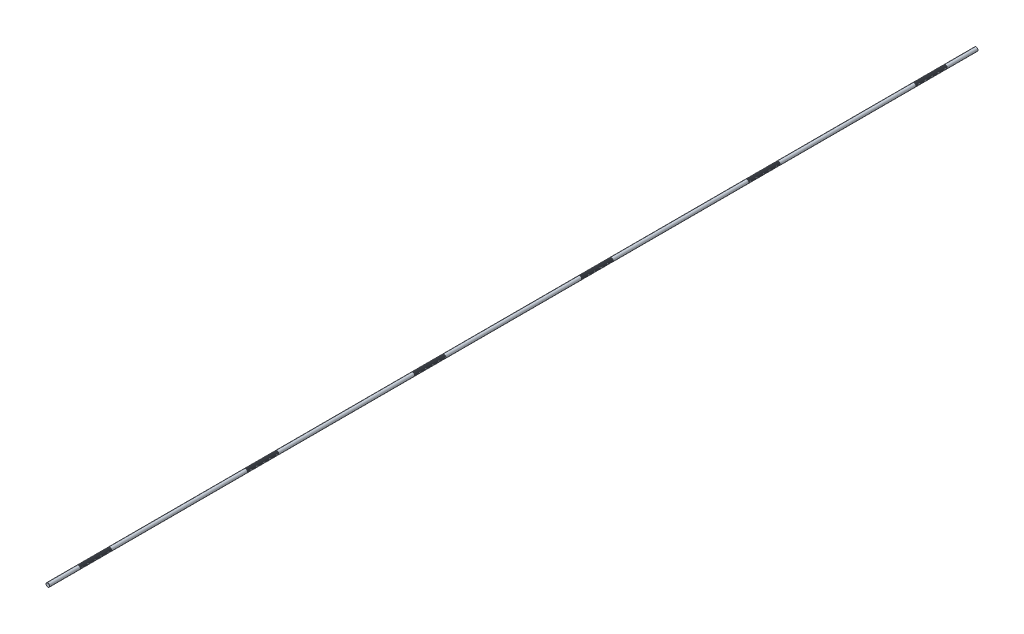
from build123d import *

# Parameters (mm, degrees)
SKETCH1_R           = 6
BOSS_EXTRUDE1_DEPTH = 1500
CHAMFER1_SIZE       = 0.3
LPATTERN1_COUNT     = 34
LPATTERN1_PITCH     = 3
LPATTERN2_COUNT     = 6
LPATTERN2_PITCH     = 540


with BuildPart() as part:
    # Sketch1 → Boss-Extrude1 (new, symmetric)
    with BuildSketch(Plane.XY):
        Circle(SKETCH1_R)
    extrude(amount=BOSS_EXTRUDE1_DEPTH, both=True)

    # Chamfer1
    chamfer1_edges = [part.edges().sort_by_distance(p)[0] for p in [
        (-6, 0, -1500),
        (-6, 0, 1500),
    ]]
    chamfer(chamfer1_edges, length=CHAMFER1_SIZE)

    # Sketch2 → Cut-Revolve1 (revolve, cut)
    with BuildSketch(Plane(origin=(0, 0, 0), x_dir=(0, 0, -1), z_dir=(1, 0, 0)), mode=Mode.PRIVATE) as cut_revolve1_sk:
        Polygon((1400.234455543, 6), (1398.265544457, 6), (1398.734455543, 4.25), (1399.765544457, 4.25), align=None)
    cut_revolve1 = revolve(cut_revolve1_sk.sketch.rotate(Axis((0, 0, 1500), (0, 0, -1)), 90), axis=Axis((0, 0, 1500), (0, 0, -1)), mode=Mode.SUBTRACT)

    # LPattern1: Cut-Revolve1 ×34
    with Locations(*[(0, 0, i * LPATTERN1_PITCH) for i in range(1, LPATTERN1_COUNT)]):
        add(cut_revolve1, mode=Mode.SUBTRACT)

    # LPattern2: Cut-Revolve1 ×6
    with Locations(*[(0, 0, i * LPATTERN2_PITCH) for i in range(1, LPATTERN2_COUNT)]):
        add(cut_revolve1, mode=Mode.SUBTRACT)

    # LPattern2 copy 1 sketch → LPattern2 copy 1 (revolve, cut)
    with BuildSketch(Plane(origin=(0, 0, 543), x_dir=(0, 0, -1), z_dir=(1, 0, 0))):
        Polygon((1400.234455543, 6), (1398.265544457, 6), (1398.734455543, 4.25), (1399.765544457, 4.25), align=None)
    revolve(axis=Axis((0, 0, 2043), (0, 0, -1)), mode=Mode.SUBTRACT)

    # LPattern2 copy 2 sketch → LPattern2 copy 2 (revolve, cut)
    with BuildSketch(Plane(origin=(0, 0, 1083), x_dir=(0, 0, -1), z_dir=(1, 0, 0))):
        Polygon((1400.234455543, 6), (1398.265544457, 6), (1398.734455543, 4.25), (1399.765544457, 4.25), align=None)
    revolve(axis=Axis((0, 0, 2583), (0, 0, -1)), mode=Mode.SUBTRACT)

    # LPattern2 copy 3 sketch → LPattern2 copy 3 (revolve, cut)
    with BuildSketch(Plane(origin=(0, 0, 1623), x_dir=(0, 0, -1), z_dir=(1, 0, 0))):
        Polygon((1400.234455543, 6), (1398.265544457, 6), (1398.734455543, 4.25), (1399.765544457, 4.25), align=None)
    revolve(axis=Axis((0, 0, 3123), (0, 0, -1)), mode=Mode.SUBTRACT)

    # LPattern2 copy 4 sketch → LPattern2 copy 4 (revolve, cut)
    with BuildSketch(Plane(origin=(0, 0, 2163), x_dir=(0, 0, -1), z_dir=(1, 0, 0))):
        Polygon((1400.234455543, 6), (1398.265544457, 6), (1398.734455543, 4.25), (1399.765544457, 4.25), align=None)
    revolve(axis=Axis((0, 0, 3663), (0, 0, -1)), mode=Mode.SUBTRACT)

    # LPattern2 copy 5 sketch → LPattern2 copy 5 (revolve, cut)
    with BuildSketch(Plane(origin=(0, 0, 2703), x_dir=(0, 0, -1), z_dir=(1, 0, 0))):
        Polygon((1400.234455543, 6), (1398.265544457, 6), (1398.734455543, 4.25), (1399.765544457, 4.25), align=None)
    revolve(axis=Axis((0, 0, 4203), (0, 0, -1)), mode=Mode.SUBTRACT)

    # LPattern2 copy 6 sketch → LPattern2 copy 6 (revolve, cut)
    with BuildSketch(Plane(origin=(0, 0, 546), x_dir=(0, 0, -1), z_dir=(1, 0, 0))):
        Polygon((1400.234455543, 6), (1398.265544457, 6), (1398.734455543, 4.25), (1399.765544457, 4.25), align=None)
    revolve(axis=Axis((0, 0, 2046), (0, 0, -1)), mode=Mode.SUBTRACT)

    # LPattern2 copy 7 sketch → LPattern2 copy 7 (revolve, cut)
    with BuildSketch(Plane(origin=(0, 0, 1086), x_dir=(0, 0, -1), z_dir=(1, 0, 0))):
        Polygon((1400.234455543, 6), (1398.265544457, 6), (1398.734455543, 4.25), (1399.765544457, 4.25), align=None)
    revolve(axis=Axis((0, 0, 2586), (0, 0, -1)), mode=Mode.SUBTRACT)

    # LPattern2 copy 8 sketch → LPattern2 copy 8 (revolve, cut)
    with BuildSketch(Plane(origin=(0, 0, 1626), x_dir=(0, 0, -1), z_dir=(1, 0, 0))):
        Polygon((1400.234455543, 6), (1398.265544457, 6), (1398.734455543, 4.25), (1399.765544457, 4.25), align=None)
    revolve(axis=Axis((0, 0, 3126), (0, 0, -1)), mode=Mode.SUBTRACT)

    # LPattern2 copy 9 sketch → LPattern2 copy 9 (revolve, cut)
    with BuildSketch(Plane(origin=(0, 0, 2166), x_dir=(0, 0, -1), z_dir=(1, 0, 0))):
        Polygon((1400.234455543, 6), (1398.265544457, 6), (1398.734455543, 4.25), (1399.765544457, 4.25), align=None)
    revolve(axis=Axis((0, 0, 3666), (0, 0, -1)), mode=Mode.SUBTRACT)

    # LPattern2 copy 10 sketch → LPattern2 copy 10 (revolve, cut)
    with BuildSketch(Plane(origin=(0, 0, 2706), x_dir=(0, 0, -1), z_dir=(1, 0, 0))):
        Polygon((1400.234455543, 6), (1398.265544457, 6), (1398.734455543, 4.25), (1399.765544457, 4.25), align=None)
    revolve(axis=Axis((0, 0, 4206), (0, 0, -1)), mode=Mode.SUBTRACT)

    # LPattern2 copy 11 sketch → LPattern2 copy 11 (revolve, cut)
    with BuildSketch(Plane(origin=(0, 0, 549), x_dir=(0, 0, -1), z_dir=(1, 0, 0))):
        Polygon((1400.234455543, 6), (1398.265544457, 6), (1398.734455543, 4.25), (1399.765544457, 4.25), align=None)
    revolve(axis=Axis((0, 0, 2049), (0, 0, -1)), mode=Mode.SUBTRACT)

    # LPattern2 copy 12 sketch → LPattern2 copy 12 (revolve, cut)
    with BuildSketch(Plane(origin=(0, 0, 1089), x_dir=(0, 0, -1), z_dir=(1, 0, 0))):
        Polygon((1400.234455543, 6), (1398.265544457, 6), (1398.734455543, 4.25), (1399.765544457, 4.25), align=None)
    revolve(axis=Axis((0, 0, 2589), (0, 0, -1)), mode=Mode.SUBTRACT)

    # LPattern2 copy 13 sketch → LPattern2 copy 13 (revolve, cut)
    with BuildSketch(Plane(origin=(0, 0, 1629), x_dir=(0, 0, -1), z_dir=(1, 0, 0))):
        Polygon((1400.234455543, 6), (1398.265544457, 6), (1398.734455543, 4.25), (1399.765544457, 4.25), align=None)
    revolve(axis=Axis((0, 0, 3129), (0, 0, -1)), mode=Mode.SUBTRACT)

    # LPattern2 copy 14 sketch → LPattern2 copy 14 (revolve, cut)
    with BuildSketch(Plane(origin=(0, 0, 2169), x_dir=(0, 0, -1), z_dir=(1, 0, 0))):
        Polygon((1400.234455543, 6), (1398.265544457, 6), (1398.734455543, 4.25), (1399.765544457, 4.25), align=None)
    revolve(axis=Axis((0, 0, 3669), (0, 0, -1)), mode=Mode.SUBTRACT)

    # LPattern2 copy 15 sketch → LPattern2 copy 15 (revolve, cut)
    with BuildSketch(Plane(origin=(0, 0, 2709), x_dir=(0, 0, -1), z_dir=(1, 0, 0))):
        Polygon((1400.234455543, 6), (1398.265544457, 6), (1398.734455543, 4.25), (1399.765544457, 4.25), align=None)
    revolve(axis=Axis((0, 0, 4209), (0, 0, -1)), mode=Mode.SUBTRACT)

    # LPattern2 copy 16 sketch → LPattern2 copy 16 (revolve, cut)
    with BuildSketch(Plane(origin=(0, 0, 552), x_dir=(0, 0, -1), z_dir=(1, 0, 0))):
        Polygon((1400.234455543, 6), (1398.265544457, 6), (1398.734455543, 4.25), (1399.765544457, 4.25), align=None)
    revolve(axis=Axis((0, 0, 2052), (0, 0, -1)), mode=Mode.SUBTRACT)

    # LPattern2 copy 17 sketch → LPattern2 copy 17 (revolve, cut)
    with BuildSketch(Plane(origin=(0, 0, 1092), x_dir=(0, 0, -1), z_dir=(1, 0, 0))):
        Polygon((1400.234455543, 6), (1398.265544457, 6), (1398.734455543, 4.25), (1399.765544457, 4.25), align=None)
    revolve(axis=Axis((0, 0, 2592), (0, 0, -1)), mode=Mode.SUBTRACT)

    # LPattern2 copy 18 sketch → LPattern2 copy 18 (revolve, cut)
    with BuildSketch(Plane(origin=(0, 0, 1632), x_dir=(0, 0, -1), z_dir=(1, 0, 0))):
        Polygon((1400.234455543, 6), (1398.265544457, 6), (1398.734455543, 4.25), (1399.765544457, 4.25), align=None)
    revolve(axis=Axis((0, 0, 3132), (0, 0, -1)), mode=Mode.SUBTRACT)

    # LPattern2 copy 19 sketch → LPattern2 copy 19 (revolve, cut)
    with BuildSketch(Plane(origin=(0, 0, 2172), x_dir=(0, 0, -1), z_dir=(1, 0, 0))):
        Polygon((1400.234455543, 6), (1398.265544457, 6), (1398.734455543, 4.25), (1399.765544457, 4.25), align=None)
    revolve(axis=Axis((0, 0, 3672), (0, 0, -1)), mode=Mode.SUBTRACT)

    # LPattern2 copy 20 sketch → LPattern2 copy 20 (revolve, cut)
    with BuildSketch(Plane(origin=(0, 0, 2712), x_dir=(0, 0, -1), z_dir=(1, 0, 0))):
        Polygon((1400.234455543, 6), (1398.265544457, 6), (1398.734455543, 4.25), (1399.765544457, 4.25), align=None)
    revolve(axis=Axis((0, 0, 4212), (0, 0, -1)), mode=Mode.SUBTRACT)

    # LPattern2 copy 21 sketch → LPattern2 copy 21 (revolve, cut)
    with BuildSketch(Plane(origin=(0, 0, 555), x_dir=(0, 0, -1), z_dir=(1, 0, 0))):
        Polygon((1400.234455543, 6), (1398.265544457, 6), (1398.734455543, 4.25), (1399.765544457, 4.25), align=None)
    revolve(axis=Axis((0, 0, 2055), (0, 0, -1)), mode=Mode.SUBTRACT)

    # LPattern2 copy 22 sketch → LPattern2 copy 22 (revolve, cut)
    with BuildSketch(Plane(origin=(0, 0, 1095), x_dir=(0, 0, -1), z_dir=(1, 0, 0))):
        Polygon((1400.234455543, 6), (1398.265544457, 6), (1398.734455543, 4.25), (1399.765544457, 4.25), align=None)
    revolve(axis=Axis((0, 0, 2595), (0, 0, -1)), mode=Mode.SUBTRACT)

    # LPattern2 copy 23 sketch → LPattern2 copy 23 (revolve, cut)
    with BuildSketch(Plane(origin=(0, 0, 1635), x_dir=(0, 0, -1), z_dir=(1, 0, 0))):
        Polygon((1400.234455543, 6), (1398.265544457, 6), (1398.734455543, 4.25), (1399.765544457, 4.25), align=None)
    revolve(axis=Axis((0, 0, 3135), (0, 0, -1)), mode=Mode.SUBTRACT)

    # LPattern2 copy 24 sketch → LPattern2 copy 24 (revolve, cut)
    with BuildSketch(Plane(origin=(0, 0, 2175), x_dir=(0, 0, -1), z_dir=(1, 0, 0))):
        Polygon((1400.234455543, 6), (1398.265544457, 6), (1398.734455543, 4.25), (1399.765544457, 4.25), align=None)
    revolve(axis=Axis((0, 0, 3675), (0, 0, -1)), mode=Mode.SUBTRACT)

    # LPattern2 copy 25 sketch → LPattern2 copy 25 (revolve, cut)
    with BuildSketch(Plane(origin=(0, 0, 2715), x_dir=(0, 0, -1), z_dir=(1, 0, 0))):
        Polygon((1400.234455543, 6), (1398.265544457, 6), (1398.734455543, 4.25), (1399.765544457, 4.25), align=None)
    revolve(axis=Axis((0, 0, 4215), (0, 0, -1)), mode=Mode.SUBTRACT)

    # LPattern2 copy 26 sketch → LPattern2 copy 26 (revolve, cut)
    with BuildSketch(Plane(origin=(0, 0, 558), x_dir=(0, 0, -1), z_dir=(1, 0, 0))):
        Polygon((1400.234455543, 6), (1398.265544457, 6), (1398.734455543, 4.25), (1399.765544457, 4.25), align=None)
    revolve(axis=Axis((0, 0, 2058), (0, 0, -1)), mode=Mode.SUBTRACT)

    # LPattern2 copy 27 sketch → LPattern2 copy 27 (revolve, cut)
    with BuildSketch(Plane(origin=(0, 0, 1098), x_dir=(0, 0, -1), z_dir=(1, 0, 0))):
        Polygon((1400.234455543, 6), (1398.265544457, 6), (1398.734455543, 4.25), (1399.765544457, 4.25), align=None)
    revolve(axis=Axis((0, 0, 2598), (0, 0, -1)), mode=Mode.SUBTRACT)

    # LPattern2 copy 28 sketch → LPattern2 copy 28 (revolve, cut)
    with BuildSketch(Plane(origin=(0, 0, 1638), x_dir=(0, 0, -1), z_dir=(1, 0, 0))):
        Polygon((1400.234455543, 6), (1398.265544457, 6), (1398.734455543, 4.25), (1399.765544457, 4.25), align=None)
    revolve(axis=Axis((0, 0, 3138), (0, 0, -1)), mode=Mode.SUBTRACT)

    # LPattern2 copy 29 sketch → LPattern2 copy 29 (revolve, cut)
    with BuildSketch(Plane(origin=(0, 0, 2178), x_dir=(0, 0, -1), z_dir=(1, 0, 0))):
        Polygon((1400.234455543, 6), (1398.265544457, 6), (1398.734455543, 4.25), (1399.765544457, 4.25), align=None)
    revolve(axis=Axis((0, 0, 3678), (0, 0, -1)), mode=Mode.SUBTRACT)

    # LPattern2 copy 30 sketch → LPattern2 copy 30 (revolve, cut)
    with BuildSketch(Plane(origin=(0, 0, 2718), x_dir=(0, 0, -1), z_dir=(1, 0, 0))):
        Polygon((1400.234455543, 6), (1398.265544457, 6), (1398.734455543, 4.25), (1399.765544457, 4.25), align=None)
    revolve(axis=Axis((0, 0, 4218), (0, 0, -1)), mode=Mode.SUBTRACT)

    # LPattern2 copy 31 sketch → LPattern2 copy 31 (revolve, cut)
    with BuildSketch(Plane(origin=(0, 0, 561), x_dir=(0, 0, -1), z_dir=(1, 0, 0))):
        Polygon((1400.234455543, 6), (1398.265544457, 6), (1398.734455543, 4.25), (1399.765544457, 4.25), align=None)
    revolve(axis=Axis((0, 0, 2061), (0, 0, -1)), mode=Mode.SUBTRACT)

    # LPattern2 copy 32 sketch → LPattern2 copy 32 (revolve, cut)
    with BuildSketch(Plane(origin=(0, 0, 1101), x_dir=(0, 0, -1), z_dir=(1, 0, 0))):
        Polygon((1400.234455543, 6), (1398.265544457, 6), (1398.734455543, 4.25), (1399.765544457, 4.25), align=None)
    revolve(axis=Axis((0, 0, 2601), (0, 0, -1)), mode=Mode.SUBTRACT)

    # LPattern2 copy 33 sketch → LPattern2 copy 33 (revolve, cut)
    with BuildSketch(Plane(origin=(0, 0, 1641), x_dir=(0, 0, -1), z_dir=(1, 0, 0))):
        Polygon((1400.234455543, 6), (1398.265544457, 6), (1398.734455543, 4.25), (1399.765544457, 4.25), align=None)
    revolve(axis=Axis((0, 0, 3141), (0, 0, -1)), mode=Mode.SUBTRACT)

    # LPattern2 copy 34 sketch → LPattern2 copy 34 (revolve, cut)
    with BuildSketch(Plane(origin=(0, 0, 2181), x_dir=(0, 0, -1), z_dir=(1, 0, 0))):
        Polygon((1400.234455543, 6), (1398.265544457, 6), (1398.734455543, 4.25), (1399.765544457, 4.25), align=None)
    revolve(axis=Axis((0, 0, 3681), (0, 0, -1)), mode=Mode.SUBTRACT)

    # LPattern2 copy 35 sketch → LPattern2 copy 35 (revolve, cut)
    with BuildSketch(Plane(origin=(0, 0, 2721), x_dir=(0, 0, -1), z_dir=(1, 0, 0))):
        Polygon((1400.234455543, 6), (1398.265544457, 6), (1398.734455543, 4.25), (1399.765544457, 4.25), align=None)
    revolve(axis=Axis((0, 0, 4221), (0, 0, -1)), mode=Mode.SUBTRACT)

    # LPattern2 copy 36 sketch → LPattern2 copy 36 (revolve, cut)
    with BuildSketch(Plane(origin=(0, 0, 564), x_dir=(0, 0, -1), z_dir=(1, 0, 0))):
        Polygon((1400.234455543, 6), (1398.265544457, 6), (1398.734455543, 4.25), (1399.765544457, 4.25), align=None)
    revolve(axis=Axis((0, 0, 2064), (0, 0, -1)), mode=Mode.SUBTRACT)

    # LPattern2 copy 37 sketch → LPattern2 copy 37 (revolve, cut)
    with BuildSketch(Plane(origin=(0, 0, 1104), x_dir=(0, 0, -1), z_dir=(1, 0, 0))):
        Polygon((1400.234455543, 6), (1398.265544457, 6), (1398.734455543, 4.25), (1399.765544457, 4.25), align=None)
    revolve(axis=Axis((0, 0, 2604), (0, 0, -1)), mode=Mode.SUBTRACT)

    # LPattern2 copy 38 sketch → LPattern2 copy 38 (revolve, cut)
    with BuildSketch(Plane(origin=(0, 0, 1644), x_dir=(0, 0, -1), z_dir=(1, 0, 0))):
        Polygon((1400.234455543, 6), (1398.265544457, 6), (1398.734455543, 4.25), (1399.765544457, 4.25), align=None)
    revolve(axis=Axis((0, 0, 3144), (0, 0, -1)), mode=Mode.SUBTRACT)

    # LPattern2 copy 39 sketch → LPattern2 copy 39 (revolve, cut)
    with BuildSketch(Plane(origin=(0, 0, 2184), x_dir=(0, 0, -1), z_dir=(1, 0, 0))):
        Polygon((1400.234455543, 6), (1398.265544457, 6), (1398.734455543, 4.25), (1399.765544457, 4.25), align=None)
    revolve(axis=Axis((0, 0, 3684), (0, 0, -1)), mode=Mode.SUBTRACT)

    # LPattern2 copy 40 sketch → LPattern2 copy 40 (revolve, cut)
    with BuildSketch(Plane(origin=(0, 0, 2724), x_dir=(0, 0, -1), z_dir=(1, 0, 0))):
        Polygon((1400.234455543, 6), (1398.265544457, 6), (1398.734455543, 4.25), (1399.765544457, 4.25), align=None)
    revolve(axis=Axis((0, 0, 4224), (0, 0, -1)), mode=Mode.SUBTRACT)

    # LPattern2 copy 41 sketch → LPattern2 copy 41 (revolve, cut)
    with BuildSketch(Plane(origin=(0, 0, 567), x_dir=(0, 0, -1), z_dir=(1, 0, 0))):
        Polygon((1400.234455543, 6), (1398.265544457, 6), (1398.734455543, 4.25), (1399.765544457, 4.25), align=None)
    revolve(axis=Axis((0, 0, 2067), (0, 0, -1)), mode=Mode.SUBTRACT)

    # LPattern2 copy 42 sketch → LPattern2 copy 42 (revolve, cut)
    with BuildSketch(Plane(origin=(0, 0, 1107), x_dir=(0, 0, -1), z_dir=(1, 0, 0))):
        Polygon((1400.234455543, 6), (1398.265544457, 6), (1398.734455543, 4.25), (1399.765544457, 4.25), align=None)
    revolve(axis=Axis((0, 0, 2607), (0, 0, -1)), mode=Mode.SUBTRACT)

    # LPattern2 copy 43 sketch → LPattern2 copy 43 (revolve, cut)
    with BuildSketch(Plane(origin=(0, 0, 1647), x_dir=(0, 0, -1), z_dir=(1, 0, 0))):
        Polygon((1400.234455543, 6), (1398.265544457, 6), (1398.734455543, 4.25), (1399.765544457, 4.25), align=None)
    revolve(axis=Axis((0, 0, 3147), (0, 0, -1)), mode=Mode.SUBTRACT)

    # LPattern2 copy 44 sketch → LPattern2 copy 44 (revolve, cut)
    with BuildSketch(Plane(origin=(0, 0, 2187), x_dir=(0, 0, -1), z_dir=(1, 0, 0))):
        Polygon((1400.234455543, 6), (1398.265544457, 6), (1398.734455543, 4.25), (1399.765544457, 4.25), align=None)
    revolve(axis=Axis((0, 0, 3687), (0, 0, -1)), mode=Mode.SUBTRACT)

    # LPattern2 copy 45 sketch → LPattern2 copy 45 (revolve, cut)
    with BuildSketch(Plane(origin=(0, 0, 2727), x_dir=(0, 0, -1), z_dir=(1, 0, 0))):
        Polygon((1400.234455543, 6), (1398.265544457, 6), (1398.734455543, 4.25), (1399.765544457, 4.25), align=None)
    revolve(axis=Axis((0, 0, 4227), (0, 0, -1)), mode=Mode.SUBTRACT)

    # LPattern2 copy 46 sketch → LPattern2 copy 46 (revolve, cut)
    with BuildSketch(Plane(origin=(0, 0, 570), x_dir=(0, 0, -1), z_dir=(1, 0, 0))):
        Polygon((1400.234455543, 6), (1398.265544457, 6), (1398.734455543, 4.25), (1399.765544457, 4.25), align=None)
    revolve(axis=Axis((0, 0, 2070), (0, 0, -1)), mode=Mode.SUBTRACT)

    # LPattern2 copy 47 sketch → LPattern2 copy 47 (revolve, cut)
    with BuildSketch(Plane(origin=(0, 0, 1110), x_dir=(0, 0, -1), z_dir=(1, 0, 0))):
        Polygon((1400.234455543, 6), (1398.265544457, 6), (1398.734455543, 4.25), (1399.765544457, 4.25), align=None)
    revolve(axis=Axis((0, 0, 2610), (0, 0, -1)), mode=Mode.SUBTRACT)

    # LPattern2 copy 48 sketch → LPattern2 copy 48 (revolve, cut)
    with BuildSketch(Plane(origin=(0, 0, 1650), x_dir=(0, 0, -1), z_dir=(1, 0, 0))):
        Polygon((1400.234455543, 6), (1398.265544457, 6), (1398.734455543, 4.25), (1399.765544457, 4.25), align=None)
    revolve(axis=Axis((0, 0, 3150), (0, 0, -1)), mode=Mode.SUBTRACT)

    # LPattern2 copy 49 sketch → LPattern2 copy 49 (revolve, cut)
    with BuildSketch(Plane(origin=(0, 0, 2190), x_dir=(0, 0, -1), z_dir=(1, 0, 0))):
        Polygon((1400.234455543, 6), (1398.265544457, 6), (1398.734455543, 4.25), (1399.765544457, 4.25), align=None)
    revolve(axis=Axis((0, 0, 3690), (0, 0, -1)), mode=Mode.SUBTRACT)

    # LPattern2 copy 50 sketch → LPattern2 copy 50 (revolve, cut)
    with BuildSketch(Plane(origin=(0, 0, 2730), x_dir=(0, 0, -1), z_dir=(1, 0, 0))):
        Polygon((1400.234455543, 6), (1398.265544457, 6), (1398.734455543, 4.25), (1399.765544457, 4.25), align=None)
    revolve(axis=Axis((0, 0, 4230), (0, 0, -1)), mode=Mode.SUBTRACT)

    # LPattern2 copy 51 sketch → LPattern2 copy 51 (revolve, cut)
    with BuildSketch(Plane(origin=(0, 0, 573), x_dir=(0, 0, -1), z_dir=(1, 0, 0))):
        Polygon((1400.234455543, 6), (1398.265544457, 6), (1398.734455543, 4.25), (1399.765544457, 4.25), align=None)
    revolve(axis=Axis((0, 0, 2073), (0, 0, -1)), mode=Mode.SUBTRACT)

    # LPattern2 copy 52 sketch → LPattern2 copy 52 (revolve, cut)
    with BuildSketch(Plane(origin=(0, 0, 1113), x_dir=(0, 0, -1), z_dir=(1, 0, 0))):
        Polygon((1400.234455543, 6), (1398.265544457, 6), (1398.734455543, 4.25), (1399.765544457, 4.25), align=None)
    revolve(axis=Axis((0, 0, 2613), (0, 0, -1)), mode=Mode.SUBTRACT)

    # LPattern2 copy 53 sketch → LPattern2 copy 53 (revolve, cut)
    with BuildSketch(Plane(origin=(0, 0, 1653), x_dir=(0, 0, -1), z_dir=(1, 0, 0))):
        Polygon((1400.234455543, 6), (1398.265544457, 6), (1398.734455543, 4.25), (1399.765544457, 4.25), align=None)
    revolve(axis=Axis((0, 0, 3153), (0, 0, -1)), mode=Mode.SUBTRACT)

    # LPattern2 copy 54 sketch → LPattern2 copy 54 (revolve, cut)
    with BuildSketch(Plane(origin=(0, 0, 2193), x_dir=(0, 0, -1), z_dir=(1, 0, 0))):
        Polygon((1400.234455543, 6), (1398.265544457, 6), (1398.734455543, 4.25), (1399.765544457, 4.25), align=None)
    revolve(axis=Axis((0, 0, 3693), (0, 0, -1)), mode=Mode.SUBTRACT)

    # LPattern2 copy 55 sketch → LPattern2 copy 55 (revolve, cut)
    with BuildSketch(Plane(origin=(0, 0, 2733), x_dir=(0, 0, -1), z_dir=(1, 0, 0))):
        Polygon((1400.234455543, 6), (1398.265544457, 6), (1398.734455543, 4.25), (1399.765544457, 4.25), align=None)
    revolve(axis=Axis((0, 0, 4233), (0, 0, -1)), mode=Mode.SUBTRACT)

    # LPattern2 copy 56 sketch → LPattern2 copy 56 (revolve, cut)
    with BuildSketch(Plane(origin=(0, 0, 576), x_dir=(0, 0, -1), z_dir=(1, 0, 0))):
        Polygon((1400.234455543, 6), (1398.265544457, 6), (1398.734455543, 4.25), (1399.765544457, 4.25), align=None)
    revolve(axis=Axis((0, 0, 2076), (0, 0, -1)), mode=Mode.SUBTRACT)

    # LPattern2 copy 57 sketch → LPattern2 copy 57 (revolve, cut)
    with BuildSketch(Plane(origin=(0, 0, 1116), x_dir=(0, 0, -1), z_dir=(1, 0, 0))):
        Polygon((1400.234455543, 6), (1398.265544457, 6), (1398.734455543, 4.25), (1399.765544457, 4.25), align=None)
    revolve(axis=Axis((0, 0, 2616), (0, 0, -1)), mode=Mode.SUBTRACT)

    # LPattern2 copy 58 sketch → LPattern2 copy 58 (revolve, cut)
    with BuildSketch(Plane(origin=(0, 0, 1656), x_dir=(0, 0, -1), z_dir=(1, 0, 0))):
        Polygon((1400.234455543, 6), (1398.265544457, 6), (1398.734455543, 4.25), (1399.765544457, 4.25), align=None)
    revolve(axis=Axis((0, 0, 3156), (0, 0, -1)), mode=Mode.SUBTRACT)

    # LPattern2 copy 59 sketch → LPattern2 copy 59 (revolve, cut)
    with BuildSketch(Plane(origin=(0, 0, 2196), x_dir=(0, 0, -1), z_dir=(1, 0, 0))):
        Polygon((1400.234455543, 6), (1398.265544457, 6), (1398.734455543, 4.25), (1399.765544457, 4.25), align=None)
    revolve(axis=Axis((0, 0, 3696), (0, 0, -1)), mode=Mode.SUBTRACT)

    # LPattern2 copy 60 sketch → LPattern2 copy 60 (revolve, cut)
    with BuildSketch(Plane(origin=(0, 0, 2736), x_dir=(0, 0, -1), z_dir=(1, 0, 0))):
        Polygon((1400.234455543, 6), (1398.265544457, 6), (1398.734455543, 4.25), (1399.765544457, 4.25), align=None)
    revolve(axis=Axis((0, 0, 4236), (0, 0, -1)), mode=Mode.SUBTRACT)

    # LPattern2 copy 61 sketch → LPattern2 copy 61 (revolve, cut)
    with BuildSketch(Plane(origin=(0, 0, 579), x_dir=(0, 0, -1), z_dir=(1, 0, 0))):
        Polygon((1400.234455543, 6), (1398.265544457, 6), (1398.734455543, 4.25), (1399.765544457, 4.25), align=None)
    revolve(axis=Axis((0, 0, 2079), (0, 0, -1)), mode=Mode.SUBTRACT)

    # LPattern2 copy 62 sketch → LPattern2 copy 62 (revolve, cut)
    with BuildSketch(Plane(origin=(0, 0, 1119), x_dir=(0, 0, -1), z_dir=(1, 0, 0))):
        Polygon((1400.234455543, 6), (1398.265544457, 6), (1398.734455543, 4.25), (1399.765544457, 4.25), align=None)
    revolve(axis=Axis((0, 0, 2619), (0, 0, -1)), mode=Mode.SUBTRACT)

    # LPattern2 copy 63 sketch → LPattern2 copy 63 (revolve, cut)
    with BuildSketch(Plane(origin=(0, 0, 1659), x_dir=(0, 0, -1), z_dir=(1, 0, 0))):
        Polygon((1400.234455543, 6), (1398.265544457, 6), (1398.734455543, 4.25), (1399.765544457, 4.25), align=None)
    revolve(axis=Axis((0, 0, 3159), (0, 0, -1)), mode=Mode.SUBTRACT)

    # LPattern2 copy 64 sketch → LPattern2 copy 64 (revolve, cut)
    with BuildSketch(Plane(origin=(0, 0, 2199), x_dir=(0, 0, -1), z_dir=(1, 0, 0))):
        Polygon((1400.234455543, 6), (1398.265544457, 6), (1398.734455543, 4.25), (1399.765544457, 4.25), align=None)
    revolve(axis=Axis((0, 0, 3699), (0, 0, -1)), mode=Mode.SUBTRACT)

    # LPattern2 copy 65 sketch → LPattern2 copy 65 (revolve, cut)
    with BuildSketch(Plane(origin=(0, 0, 2739), x_dir=(0, 0, -1), z_dir=(1, 0, 0))):
        Polygon((1400.234455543, 6), (1398.265544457, 6), (1398.734455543, 4.25), (1399.765544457, 4.25), align=None)
    revolve(axis=Axis((0, 0, 4239), (0, 0, -1)), mode=Mode.SUBTRACT)

    # LPattern2 copy 66 sketch → LPattern2 copy 66 (revolve, cut)
    with BuildSketch(Plane(origin=(0, 0, 582), x_dir=(0, 0, -1), z_dir=(1, 0, 0))):
        Polygon((1400.234455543, 6), (1398.265544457, 6), (1398.734455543, 4.25), (1399.765544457, 4.25), align=None)
    revolve(axis=Axis((0, 0, 2082), (0, 0, -1)), mode=Mode.SUBTRACT)

    # LPattern2 copy 67 sketch → LPattern2 copy 67 (revolve, cut)
    with BuildSketch(Plane(origin=(0, 0, 1122), x_dir=(0, 0, -1), z_dir=(1, 0, 0))):
        Polygon((1400.234455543, 6), (1398.265544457, 6), (1398.734455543, 4.25), (1399.765544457, 4.25), align=None)
    revolve(axis=Axis((0, 0, 2622), (0, 0, -1)), mode=Mode.SUBTRACT)

    # LPattern2 copy 68 sketch → LPattern2 copy 68 (revolve, cut)
    with BuildSketch(Plane(origin=(0, 0, 1662), x_dir=(0, 0, -1), z_dir=(1, 0, 0))):
        Polygon((1400.234455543, 6), (1398.265544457, 6), (1398.734455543, 4.25), (1399.765544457, 4.25), align=None)
    revolve(axis=Axis((0, 0, 3162), (0, 0, -1)), mode=Mode.SUBTRACT)

    # LPattern2 copy 69 sketch → LPattern2 copy 69 (revolve, cut)
    with BuildSketch(Plane(origin=(0, 0, 2202), x_dir=(0, 0, -1), z_dir=(1, 0, 0))):
        Polygon((1400.234455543, 6), (1398.265544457, 6), (1398.734455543, 4.25), (1399.765544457, 4.25), align=None)
    revolve(axis=Axis((0, 0, 3702), (0, 0, -1)), mode=Mode.SUBTRACT)

    # LPattern2 copy 70 sketch → LPattern2 copy 70 (revolve, cut)
    with BuildSketch(Plane(origin=(0, 0, 2742), x_dir=(0, 0, -1), z_dir=(1, 0, 0))):
        Polygon((1400.234455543, 6), (1398.265544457, 6), (1398.734455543, 4.25), (1399.765544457, 4.25), align=None)
    revolve(axis=Axis((0, 0, 4242), (0, 0, -1)), mode=Mode.SUBTRACT)

    # LPattern2 copy 71 sketch → LPattern2 copy 71 (revolve, cut)
    with BuildSketch(Plane(origin=(0, 0, 585), x_dir=(0, 0, -1), z_dir=(1, 0, 0))):
        Polygon((1400.234455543, 6), (1398.265544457, 6), (1398.734455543, 4.25), (1399.765544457, 4.25), align=None)
    revolve(axis=Axis((0, 0, 2085), (0, 0, -1)), mode=Mode.SUBTRACT)

    # LPattern2 copy 72 sketch → LPattern2 copy 72 (revolve, cut)
    with BuildSketch(Plane(origin=(0, 0, 1125), x_dir=(0, 0, -1), z_dir=(1, 0, 0))):
        Polygon((1400.234455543, 6), (1398.265544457, 6), (1398.734455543, 4.25), (1399.765544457, 4.25), align=None)
    revolve(axis=Axis((0, 0, 2625), (0, 0, -1)), mode=Mode.SUBTRACT)

    # LPattern2 copy 73 sketch → LPattern2 copy 73 (revolve, cut)
    with BuildSketch(Plane(origin=(0, 0, 1665), x_dir=(0, 0, -1), z_dir=(1, 0, 0))):
        Polygon((1400.234455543, 6), (1398.265544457, 6), (1398.734455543, 4.25), (1399.765544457, 4.25), align=None)
    revolve(axis=Axis((0, 0, 3165), (0, 0, -1)), mode=Mode.SUBTRACT)

    # LPattern2 copy 74 sketch → LPattern2 copy 74 (revolve, cut)
    with BuildSketch(Plane(origin=(0, 0, 2205), x_dir=(0, 0, -1), z_dir=(1, 0, 0))):
        Polygon((1400.234455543, 6), (1398.265544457, 6), (1398.734455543, 4.25), (1399.765544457, 4.25), align=None)
    revolve(axis=Axis((0, 0, 3705), (0, 0, -1)), mode=Mode.SUBTRACT)

    # LPattern2 copy 75 sketch → LPattern2 copy 75 (revolve, cut)
    with BuildSketch(Plane(origin=(0, 0, 2745), x_dir=(0, 0, -1), z_dir=(1, 0, 0))):
        Polygon((1400.234455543, 6), (1398.265544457, 6), (1398.734455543, 4.25), (1399.765544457, 4.25), align=None)
    revolve(axis=Axis((0, 0, 4245), (0, 0, -1)), mode=Mode.SUBTRACT)

    # LPattern2 copy 76 sketch → LPattern2 copy 76 (revolve, cut)
    with BuildSketch(Plane(origin=(0, 0, 588), x_dir=(0, 0, -1), z_dir=(1, 0, 0))):
        Polygon((1400.234455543, 6), (1398.265544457, 6), (1398.734455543, 4.25), (1399.765544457, 4.25), align=None)
    revolve(axis=Axis((0, 0, 2088), (0, 0, -1)), mode=Mode.SUBTRACT)

    # LPattern2 copy 77 sketch → LPattern2 copy 77 (revolve, cut)
    with BuildSketch(Plane(origin=(0, 0, 1128), x_dir=(0, 0, -1), z_dir=(1, 0, 0))):
        Polygon((1400.234455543, 6), (1398.265544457, 6), (1398.734455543, 4.25), (1399.765544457, 4.25), align=None)
    revolve(axis=Axis((0, 0, 2628), (0, 0, -1)), mode=Mode.SUBTRACT)

    # LPattern2 copy 78 sketch → LPattern2 copy 78 (revolve, cut)
    with BuildSketch(Plane(origin=(0, 0, 1668), x_dir=(0, 0, -1), z_dir=(1, 0, 0))):
        Polygon((1400.234455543, 6), (1398.265544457, 6), (1398.734455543, 4.25), (1399.765544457, 4.25), align=None)
    revolve(axis=Axis((0, 0, 3168), (0, 0, -1)), mode=Mode.SUBTRACT)

    # LPattern2 copy 79 sketch → LPattern2 copy 79 (revolve, cut)
    with BuildSketch(Plane(origin=(0, 0, 2208), x_dir=(0, 0, -1), z_dir=(1, 0, 0))):
        Polygon((1400.234455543, 6), (1398.265544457, 6), (1398.734455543, 4.25), (1399.765544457, 4.25), align=None)
    revolve(axis=Axis((0, 0, 3708), (0, 0, -1)), mode=Mode.SUBTRACT)

    # LPattern2 copy 80 sketch → LPattern2 copy 80 (revolve, cut)
    with BuildSketch(Plane(origin=(0, 0, 2748), x_dir=(0, 0, -1), z_dir=(1, 0, 0))):
        Polygon((1400.234455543, 6), (1398.265544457, 6), (1398.734455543, 4.25), (1399.765544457, 4.25), align=None)
    revolve(axis=Axis((0, 0, 4248), (0, 0, -1)), mode=Mode.SUBTRACT)

    # LPattern2 copy 81 sketch → LPattern2 copy 81 (revolve, cut)
    with BuildSketch(Plane(origin=(0, 0, 591), x_dir=(0, 0, -1), z_dir=(1, 0, 0))):
        Polygon((1400.234455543, 6), (1398.265544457, 6), (1398.734455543, 4.25), (1399.765544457, 4.25), align=None)
    revolve(axis=Axis((0, 0, 2091), (0, 0, -1)), mode=Mode.SUBTRACT)

    # LPattern2 copy 82 sketch → LPattern2 copy 82 (revolve, cut)
    with BuildSketch(Plane(origin=(0, 0, 1131), x_dir=(0, 0, -1), z_dir=(1, 0, 0))):
        Polygon((1400.234455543, 6), (1398.265544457, 6), (1398.734455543, 4.25), (1399.765544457, 4.25), align=None)
    revolve(axis=Axis((0, 0, 2631), (0, 0, -1)), mode=Mode.SUBTRACT)

    # LPattern2 copy 83 sketch → LPattern2 copy 83 (revolve, cut)
    with BuildSketch(Plane(origin=(0, 0, 1671), x_dir=(0, 0, -1), z_dir=(1, 0, 0))):
        Polygon((1400.234455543, 6), (1398.265544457, 6), (1398.734455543, 4.25), (1399.765544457, 4.25), align=None)
    revolve(axis=Axis((0, 0, 3171), (0, 0, -1)), mode=Mode.SUBTRACT)

    # LPattern2 copy 84 sketch → LPattern2 copy 84 (revolve, cut)
    with BuildSketch(Plane(origin=(0, 0, 2211), x_dir=(0, 0, -1), z_dir=(1, 0, 0))):
        Polygon((1400.234455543, 6), (1398.265544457, 6), (1398.734455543, 4.25), (1399.765544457, 4.25), align=None)
    revolve(axis=Axis((0, 0, 3711), (0, 0, -1)), mode=Mode.SUBTRACT)

    # LPattern2 copy 85 sketch → LPattern2 copy 85 (revolve, cut)
    with BuildSketch(Plane(origin=(0, 0, 2751), x_dir=(0, 0, -1), z_dir=(1, 0, 0))):
        Polygon((1400.234455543, 6), (1398.265544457, 6), (1398.734455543, 4.25), (1399.765544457, 4.25), align=None)
    revolve(axis=Axis((0, 0, 4251), (0, 0, -1)), mode=Mode.SUBTRACT)

    # LPattern2 copy 86 sketch → LPattern2 copy 86 (revolve, cut)
    with BuildSketch(Plane(origin=(0, 0, 594), x_dir=(0, 0, -1), z_dir=(1, 0, 0))):
        Polygon((1400.234455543, 6), (1398.265544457, 6), (1398.734455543, 4.25), (1399.765544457, 4.25), align=None)
    revolve(axis=Axis((0, 0, 2094), (0, 0, -1)), mode=Mode.SUBTRACT)

    # LPattern2 copy 87 sketch → LPattern2 copy 87 (revolve, cut)
    with BuildSketch(Plane(origin=(0, 0, 1134), x_dir=(0, 0, -1), z_dir=(1, 0, 0))):
        Polygon((1400.234455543, 6), (1398.265544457, 6), (1398.734455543, 4.25), (1399.765544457, 4.25), align=None)
    revolve(axis=Axis((0, 0, 2634), (0, 0, -1)), mode=Mode.SUBTRACT)

    # LPattern2 copy 88 sketch → LPattern2 copy 88 (revolve, cut)
    with BuildSketch(Plane(origin=(0, 0, 1674), x_dir=(0, 0, -1), z_dir=(1, 0, 0))):
        Polygon((1400.234455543, 6), (1398.265544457, 6), (1398.734455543, 4.25), (1399.765544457, 4.25), align=None)
    revolve(axis=Axis((0, 0, 3174), (0, 0, -1)), mode=Mode.SUBTRACT)

    # LPattern2 copy 89 sketch → LPattern2 copy 89 (revolve, cut)
    with BuildSketch(Plane(origin=(0, 0, 2214), x_dir=(0, 0, -1), z_dir=(1, 0, 0))):
        Polygon((1400.234455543, 6), (1398.265544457, 6), (1398.734455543, 4.25), (1399.765544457, 4.25), align=None)
    revolve(axis=Axis((0, 0, 3714), (0, 0, -1)), mode=Mode.SUBTRACT)

    # LPattern2 copy 90 sketch → LPattern2 copy 90 (revolve, cut)
    with BuildSketch(Plane(origin=(0, 0, 2754), x_dir=(0, 0, -1), z_dir=(1, 0, 0))):
        Polygon((1400.234455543, 6), (1398.265544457, 6), (1398.734455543, 4.25), (1399.765544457, 4.25), align=None)
    revolve(axis=Axis((0, 0, 4254), (0, 0, -1)), mode=Mode.SUBTRACT)

    # LPattern2 copy 91 sketch → LPattern2 copy 91 (revolve, cut)
    with BuildSketch(Plane(origin=(0, 0, 597), x_dir=(0, 0, -1), z_dir=(1, 0, 0))):
        Polygon((1400.234455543, 6), (1398.265544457, 6), (1398.734455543, 4.25), (1399.765544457, 4.25), align=None)
    revolve(axis=Axis((0, 0, 2097), (0, 0, -1)), mode=Mode.SUBTRACT)

    # LPattern2 copy 92 sketch → LPattern2 copy 92 (revolve, cut)
    with BuildSketch(Plane(origin=(0, 0, 1137), x_dir=(0, 0, -1), z_dir=(1, 0, 0))):
        Polygon((1400.234455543, 6), (1398.265544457, 6), (1398.734455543, 4.25), (1399.765544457, 4.25), align=None)
    revolve(axis=Axis((0, 0, 2637), (0, 0, -1)), mode=Mode.SUBTRACT)

    # LPattern2 copy 93 sketch → LPattern2 copy 93 (revolve, cut)
    with BuildSketch(Plane(origin=(0, 0, 1677), x_dir=(0, 0, -1), z_dir=(1, 0, 0))):
        Polygon((1400.234455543, 6), (1398.265544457, 6), (1398.734455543, 4.25), (1399.765544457, 4.25), align=None)
    revolve(axis=Axis((0, 0, 3177), (0, 0, -1)), mode=Mode.SUBTRACT)

    # LPattern2 copy 94 sketch → LPattern2 copy 94 (revolve, cut)
    with BuildSketch(Plane(origin=(0, 0, 2217), x_dir=(0, 0, -1), z_dir=(1, 0, 0))):
        Polygon((1400.234455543, 6), (1398.265544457, 6), (1398.734455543, 4.25), (1399.765544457, 4.25), align=None)
    revolve(axis=Axis((0, 0, 3717), (0, 0, -1)), mode=Mode.SUBTRACT)

    # LPattern2 copy 95 sketch → LPattern2 copy 95 (revolve, cut)
    with BuildSketch(Plane(origin=(0, 0, 2757), x_dir=(0, 0, -1), z_dir=(1, 0, 0))):
        Polygon((1400.234455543, 6), (1398.265544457, 6), (1398.734455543, 4.25), (1399.765544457, 4.25), align=None)
    revolve(axis=Axis((0, 0, 4257), (0, 0, -1)), mode=Mode.SUBTRACT)

    # LPattern2 copy 96 sketch → LPattern2 copy 96 (revolve, cut)
    with BuildSketch(Plane(origin=(0, 0, 600), x_dir=(0, 0, -1), z_dir=(1, 0, 0))):
        Polygon((1400.234455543, 6), (1398.265544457, 6), (1398.734455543, 4.25), (1399.765544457, 4.25), align=None)
    revolve(axis=Axis((0, 0, 2100), (0, 0, -1)), mode=Mode.SUBTRACT)

    # LPattern2 copy 97 sketch → LPattern2 copy 97 (revolve, cut)
    with BuildSketch(Plane(origin=(0, 0, 1140), x_dir=(0, 0, -1), z_dir=(1, 0, 0))):
        Polygon((1400.234455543, 6), (1398.265544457, 6), (1398.734455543, 4.25), (1399.765544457, 4.25), align=None)
    revolve(axis=Axis((0, 0, 2640), (0, 0, -1)), mode=Mode.SUBTRACT)

    # LPattern2 copy 98 sketch → LPattern2 copy 98 (revolve, cut)
    with BuildSketch(Plane(origin=(0, 0, 1680), x_dir=(0, 0, -1), z_dir=(1, 0, 0))):
        Polygon((1400.234455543, 6), (1398.265544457, 6), (1398.734455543, 4.25), (1399.765544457, 4.25), align=None)
    revolve(axis=Axis((0, 0, 3180), (0, 0, -1)), mode=Mode.SUBTRACT)

    # LPattern2 copy 99 sketch → LPattern2 copy 99 (revolve, cut)
    with BuildSketch(Plane(origin=(0, 0, 2220), x_dir=(0, 0, -1), z_dir=(1, 0, 0))):
        Polygon((1400.234455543, 6), (1398.265544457, 6), (1398.734455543, 4.25), (1399.765544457, 4.25), align=None)
    revolve(axis=Axis((0, 0, 3720), (0, 0, -1)), mode=Mode.SUBTRACT)

    # LPattern2 copy 100 sketch → LPattern2 copy 100 (revolve, cut)
    with BuildSketch(Plane(origin=(0, 0, 2760), x_dir=(0, 0, -1), z_dir=(1, 0, 0))):
        Polygon((1400.234455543, 6), (1398.265544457, 6), (1398.734455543, 4.25), (1399.765544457, 4.25), align=None)
    revolve(axis=Axis((0, 0, 4260), (0, 0, -1)), mode=Mode.SUBTRACT)

    # LPattern2 copy 101 sketch → LPattern2 copy 101 (revolve, cut)
    with BuildSketch(Plane(origin=(0, 0, 603), x_dir=(0, 0, -1), z_dir=(1, 0, 0))):
        Polygon((1400.234455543, 6), (1398.265544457, 6), (1398.734455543, 4.25), (1399.765544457, 4.25), align=None)
    revolve(axis=Axis((0, 0, 2103), (0, 0, -1)), mode=Mode.SUBTRACT)

    # LPattern2 copy 102 sketch → LPattern2 copy 102 (revolve, cut)
    with BuildSketch(Plane(origin=(0, 0, 1143), x_dir=(0, 0, -1), z_dir=(1, 0, 0))):
        Polygon((1400.234455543, 6), (1398.265544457, 6), (1398.734455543, 4.25), (1399.765544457, 4.25), align=None)
    revolve(axis=Axis((0, 0, 2643), (0, 0, -1)), mode=Mode.SUBTRACT)

    # LPattern2 copy 103 sketch → LPattern2 copy 103 (revolve, cut)
    with BuildSketch(Plane(origin=(0, 0, 1683), x_dir=(0, 0, -1), z_dir=(1, 0, 0))):
        Polygon((1400.234455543, 6), (1398.265544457, 6), (1398.734455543, 4.25), (1399.765544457, 4.25), align=None)
    revolve(axis=Axis((0, 0, 3183), (0, 0, -1)), mode=Mode.SUBTRACT)

    # LPattern2 copy 104 sketch → LPattern2 copy 104 (revolve, cut)
    with BuildSketch(Plane(origin=(0, 0, 2223), x_dir=(0, 0, -1), z_dir=(1, 0, 0))):
        Polygon((1400.234455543, 6), (1398.265544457, 6), (1398.734455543, 4.25), (1399.765544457, 4.25), align=None)
    revolve(axis=Axis((0, 0, 3723), (0, 0, -1)), mode=Mode.SUBTRACT)

    # LPattern2 copy 105 sketch → LPattern2 copy 105 (revolve, cut)
    with BuildSketch(Plane(origin=(0, 0, 2763), x_dir=(0, 0, -1), z_dir=(1, 0, 0))):
        Polygon((1400.234455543, 6), (1398.265544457, 6), (1398.734455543, 4.25), (1399.765544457, 4.25), align=None)
    revolve(axis=Axis((0, 0, 4263), (0, 0, -1)), mode=Mode.SUBTRACT)

    # LPattern2 copy 106 sketch → LPattern2 copy 106 (revolve, cut)
    with BuildSketch(Plane(origin=(0, 0, 606), x_dir=(0, 0, -1), z_dir=(1, 0, 0))):
        Polygon((1400.234455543, 6), (1398.265544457, 6), (1398.734455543, 4.25), (1399.765544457, 4.25), align=None)
    revolve(axis=Axis((0, 0, 2106), (0, 0, -1)), mode=Mode.SUBTRACT)

    # LPattern2 copy 107 sketch → LPattern2 copy 107 (revolve, cut)
    with BuildSketch(Plane(origin=(0, 0, 1146), x_dir=(0, 0, -1), z_dir=(1, 0, 0))):
        Polygon((1400.234455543, 6), (1398.265544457, 6), (1398.734455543, 4.25), (1399.765544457, 4.25), align=None)
    revolve(axis=Axis((0, 0, 2646), (0, 0, -1)), mode=Mode.SUBTRACT)

    # LPattern2 copy 108 sketch → LPattern2 copy 108 (revolve, cut)
    with BuildSketch(Plane(origin=(0, 0, 1686), x_dir=(0, 0, -1), z_dir=(1, 0, 0))):
        Polygon((1400.234455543, 6), (1398.265544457, 6), (1398.734455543, 4.25), (1399.765544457, 4.25), align=None)
    revolve(axis=Axis((0, 0, 3186), (0, 0, -1)), mode=Mode.SUBTRACT)

    # LPattern2 copy 109 sketch → LPattern2 copy 109 (revolve, cut)
    with BuildSketch(Plane(origin=(0, 0, 2226), x_dir=(0, 0, -1), z_dir=(1, 0, 0))):
        Polygon((1400.234455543, 6), (1398.265544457, 6), (1398.734455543, 4.25), (1399.765544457, 4.25), align=None)
    revolve(axis=Axis((0, 0, 3726), (0, 0, -1)), mode=Mode.SUBTRACT)

    # LPattern2 copy 110 sketch → LPattern2 copy 110 (revolve, cut)
    with BuildSketch(Plane(origin=(0, 0, 2766), x_dir=(0, 0, -1), z_dir=(1, 0, 0))):
        Polygon((1400.234455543, 6), (1398.265544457, 6), (1398.734455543, 4.25), (1399.765544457, 4.25), align=None)
    revolve(axis=Axis((0, 0, 4266), (0, 0, -1)), mode=Mode.SUBTRACT)

    # LPattern2 copy 111 sketch → LPattern2 copy 111 (revolve, cut)
    with BuildSketch(Plane(origin=(0, 0, 609), x_dir=(0, 0, -1), z_dir=(1, 0, 0))):
        Polygon((1400.234455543, 6), (1398.265544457, 6), (1398.734455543, 4.25), (1399.765544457, 4.25), align=None)
    revolve(axis=Axis((0, 0, 2109), (0, 0, -1)), mode=Mode.SUBTRACT)

    # LPattern2 copy 112 sketch → LPattern2 copy 112 (revolve, cut)
    with BuildSketch(Plane(origin=(0, 0, 1149), x_dir=(0, 0, -1), z_dir=(1, 0, 0))):
        Polygon((1400.234455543, 6), (1398.265544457, 6), (1398.734455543, 4.25), (1399.765544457, 4.25), align=None)
    revolve(axis=Axis((0, 0, 2649), (0, 0, -1)), mode=Mode.SUBTRACT)

    # LPattern2 copy 113 sketch → LPattern2 copy 113 (revolve, cut)
    with BuildSketch(Plane(origin=(0, 0, 1689), x_dir=(0, 0, -1), z_dir=(1, 0, 0))):
        Polygon((1400.234455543, 6), (1398.265544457, 6), (1398.734455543, 4.25), (1399.765544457, 4.25), align=None)
    revolve(axis=Axis((0, 0, 3189), (0, 0, -1)), mode=Mode.SUBTRACT)

    # LPattern2 copy 114 sketch → LPattern2 copy 114 (revolve, cut)
    with BuildSketch(Plane(origin=(0, 0, 2229), x_dir=(0, 0, -1), z_dir=(1, 0, 0))):
        Polygon((1400.234455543, 6), (1398.265544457, 6), (1398.734455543, 4.25), (1399.765544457, 4.25), align=None)
    revolve(axis=Axis((0, 0, 3729), (0, 0, -1)), mode=Mode.SUBTRACT)

    # LPattern2 copy 115 sketch → LPattern2 copy 115 (revolve, cut)
    with BuildSketch(Plane(origin=(0, 0, 2769), x_dir=(0, 0, -1), z_dir=(1, 0, 0))):
        Polygon((1400.234455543, 6), (1398.265544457, 6), (1398.734455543, 4.25), (1399.765544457, 4.25), align=None)
    revolve(axis=Axis((0, 0, 4269), (0, 0, -1)), mode=Mode.SUBTRACT)

    # LPattern2 copy 116 sketch → LPattern2 copy 116 (revolve, cut)
    with BuildSketch(Plane(origin=(0, 0, 612), x_dir=(0, 0, -1), z_dir=(1, 0, 0))):
        Polygon((1400.234455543, 6), (1398.265544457, 6), (1398.734455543, 4.25), (1399.765544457, 4.25), align=None)
    revolve(axis=Axis((0, 0, 2112), (0, 0, -1)), mode=Mode.SUBTRACT)

    # LPattern2 copy 117 sketch → LPattern2 copy 117 (revolve, cut)
    with BuildSketch(Plane(origin=(0, 0, 1152), x_dir=(0, 0, -1), z_dir=(1, 0, 0))):
        Polygon((1400.234455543, 6), (1398.265544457, 6), (1398.734455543, 4.25), (1399.765544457, 4.25), align=None)
    revolve(axis=Axis((0, 0, 2652), (0, 0, -1)), mode=Mode.SUBTRACT)

    # LPattern2 copy 118 sketch → LPattern2 copy 118 (revolve, cut)
    with BuildSketch(Plane(origin=(0, 0, 1692), x_dir=(0, 0, -1), z_dir=(1, 0, 0))):
        Polygon((1400.234455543, 6), (1398.265544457, 6), (1398.734455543, 4.25), (1399.765544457, 4.25), align=None)
    revolve(axis=Axis((0, 0, 3192), (0, 0, -1)), mode=Mode.SUBTRACT)

    # LPattern2 copy 119 sketch → LPattern2 copy 119 (revolve, cut)
    with BuildSketch(Plane(origin=(0, 0, 2232), x_dir=(0, 0, -1), z_dir=(1, 0, 0))):
        Polygon((1400.234455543, 6), (1398.265544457, 6), (1398.734455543, 4.25), (1399.765544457, 4.25), align=None)
    revolve(axis=Axis((0, 0, 3732), (0, 0, -1)), mode=Mode.SUBTRACT)

    # LPattern2 copy 120 sketch → LPattern2 copy 120 (revolve, cut)
    with BuildSketch(Plane(origin=(0, 0, 2772), x_dir=(0, 0, -1), z_dir=(1, 0, 0))):
        Polygon((1400.234455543, 6), (1398.265544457, 6), (1398.734455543, 4.25), (1399.765544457, 4.25), align=None)
    revolve(axis=Axis((0, 0, 4272), (0, 0, -1)), mode=Mode.SUBTRACT)

    # LPattern2 copy 121 sketch → LPattern2 copy 121 (revolve, cut)
    with BuildSketch(Plane(origin=(0, 0, 615), x_dir=(0, 0, -1), z_dir=(1, 0, 0))):
        Polygon((1400.234455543, 6), (1398.265544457, 6), (1398.734455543, 4.25), (1399.765544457, 4.25), align=None)
    revolve(axis=Axis((0, 0, 2115), (0, 0, -1)), mode=Mode.SUBTRACT)

    # LPattern2 copy 122 sketch → LPattern2 copy 122 (revolve, cut)
    with BuildSketch(Plane(origin=(0, 0, 1155), x_dir=(0, 0, -1), z_dir=(1, 0, 0))):
        Polygon((1400.234455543, 6), (1398.265544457, 6), (1398.734455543, 4.25), (1399.765544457, 4.25), align=None)
    revolve(axis=Axis((0, 0, 2655), (0, 0, -1)), mode=Mode.SUBTRACT)

    # LPattern2 copy 123 sketch → LPattern2 copy 123 (revolve, cut)
    with BuildSketch(Plane(origin=(0, 0, 1695), x_dir=(0, 0, -1), z_dir=(1, 0, 0))):
        Polygon((1400.234455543, 6), (1398.265544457, 6), (1398.734455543, 4.25), (1399.765544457, 4.25), align=None)
    revolve(axis=Axis((0, 0, 3195), (0, 0, -1)), mode=Mode.SUBTRACT)

    # LPattern2 copy 124 sketch → LPattern2 copy 124 (revolve, cut)
    with BuildSketch(Plane(origin=(0, 0, 2235), x_dir=(0, 0, -1), z_dir=(1, 0, 0))):
        Polygon((1400.234455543, 6), (1398.265544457, 6), (1398.734455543, 4.25), (1399.765544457, 4.25), align=None)
    revolve(axis=Axis((0, 0, 3735), (0, 0, -1)), mode=Mode.SUBTRACT)

    # LPattern2 copy 125 sketch → LPattern2 copy 125 (revolve, cut)
    with BuildSketch(Plane(origin=(0, 0, 2775), x_dir=(0, 0, -1), z_dir=(1, 0, 0))):
        Polygon((1400.234455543, 6), (1398.265544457, 6), (1398.734455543, 4.25), (1399.765544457, 4.25), align=None)
    revolve(axis=Axis((0, 0, 4275), (0, 0, -1)), mode=Mode.SUBTRACT)

    # LPattern2 copy 126 sketch → LPattern2 copy 126 (revolve, cut)
    with BuildSketch(Plane(origin=(0, 0, 618), x_dir=(0, 0, -1), z_dir=(1, 0, 0))):
        Polygon((1400.234455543, 6), (1398.265544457, 6), (1398.734455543, 4.25), (1399.765544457, 4.25), align=None)
    revolve(axis=Axis((0, 0, 2118), (0, 0, -1)), mode=Mode.SUBTRACT)

    # LPattern2 copy 127 sketch → LPattern2 copy 127 (revolve, cut)
    with BuildSketch(Plane(origin=(0, 0, 1158), x_dir=(0, 0, -1), z_dir=(1, 0, 0))):
        Polygon((1400.234455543, 6), (1398.265544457, 6), (1398.734455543, 4.25), (1399.765544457, 4.25), align=None)
    revolve(axis=Axis((0, 0, 2658), (0, 0, -1)), mode=Mode.SUBTRACT)

    # LPattern2 copy 128 sketch → LPattern2 copy 128 (revolve, cut)
    with BuildSketch(Plane(origin=(0, 0, 1698), x_dir=(0, 0, -1), z_dir=(1, 0, 0))):
        Polygon((1400.234455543, 6), (1398.265544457, 6), (1398.734455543, 4.25), (1399.765544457, 4.25), align=None)
    revolve(axis=Axis((0, 0, 3198), (0, 0, -1)), mode=Mode.SUBTRACT)

    # LPattern2 copy 129 sketch → LPattern2 copy 129 (revolve, cut)
    with BuildSketch(Plane(origin=(0, 0, 2238), x_dir=(0, 0, -1), z_dir=(1, 0, 0))):
        Polygon((1400.234455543, 6), (1398.265544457, 6), (1398.734455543, 4.25), (1399.765544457, 4.25), align=None)
    revolve(axis=Axis((0, 0, 3738), (0, 0, -1)), mode=Mode.SUBTRACT)

    # LPattern2 copy 130 sketch → LPattern2 copy 130 (revolve, cut)
    with BuildSketch(Plane(origin=(0, 0, 2778), x_dir=(0, 0, -1), z_dir=(1, 0, 0))):
        Polygon((1400.234455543, 6), (1398.265544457, 6), (1398.734455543, 4.25), (1399.765544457, 4.25), align=None)
    revolve(axis=Axis((0, 0, 4278), (0, 0, -1)), mode=Mode.SUBTRACT)

    # LPattern2 copy 131 sketch → LPattern2 copy 131 (revolve, cut)
    with BuildSketch(Plane(origin=(0, 0, 621), x_dir=(0, 0, -1), z_dir=(1, 0, 0))):
        Polygon((1400.234455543, 6), (1398.265544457, 6), (1398.734455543, 4.25), (1399.765544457, 4.25), align=None)
    revolve(axis=Axis((0, 0, 2121), (0, 0, -1)), mode=Mode.SUBTRACT)

    # LPattern2 copy 132 sketch → LPattern2 copy 132 (revolve, cut)
    with BuildSketch(Plane(origin=(0, 0, 1161), x_dir=(0, 0, -1), z_dir=(1, 0, 0))):
        Polygon((1400.234455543, 6), (1398.265544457, 6), (1398.734455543, 4.25), (1399.765544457, 4.25), align=None)
    revolve(axis=Axis((0, 0, 2661), (0, 0, -1)), mode=Mode.SUBTRACT)

    # LPattern2 copy 133 sketch → LPattern2 copy 133 (revolve, cut)
    with BuildSketch(Plane(origin=(0, 0, 1701), x_dir=(0, 0, -1), z_dir=(1, 0, 0))):
        Polygon((1400.234455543, 6), (1398.265544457, 6), (1398.734455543, 4.25), (1399.765544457, 4.25), align=None)
    revolve(axis=Axis((0, 0, 3201), (0, 0, -1)), mode=Mode.SUBTRACT)

    # LPattern2 copy 134 sketch → LPattern2 copy 134 (revolve, cut)
    with BuildSketch(Plane(origin=(0, 0, 2241), x_dir=(0, 0, -1), z_dir=(1, 0, 0))):
        Polygon((1400.234455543, 6), (1398.265544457, 6), (1398.734455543, 4.25), (1399.765544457, 4.25), align=None)
    revolve(axis=Axis((0, 0, 3741), (0, 0, -1)), mode=Mode.SUBTRACT)

    # LPattern2 copy 135 sketch → LPattern2 copy 135 (revolve, cut)
    with BuildSketch(Plane(origin=(0, 0, 2781), x_dir=(0, 0, -1), z_dir=(1, 0, 0))):
        Polygon((1400.234455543, 6), (1398.265544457, 6), (1398.734455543, 4.25), (1399.765544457, 4.25), align=None)
    revolve(axis=Axis((0, 0, 4281), (0, 0, -1)), mode=Mode.SUBTRACT)

    # LPattern2 copy 136 sketch → LPattern2 copy 136 (revolve, cut)
    with BuildSketch(Plane(origin=(0, 0, 624), x_dir=(0, 0, -1), z_dir=(1, 0, 0))):
        Polygon((1400.234455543, 6), (1398.265544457, 6), (1398.734455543, 4.25), (1399.765544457, 4.25), align=None)
    revolve(axis=Axis((0, 0, 2124), (0, 0, -1)), mode=Mode.SUBTRACT)

    # LPattern2 copy 137 sketch → LPattern2 copy 137 (revolve, cut)
    with BuildSketch(Plane(origin=(0, 0, 1164), x_dir=(0, 0, -1), z_dir=(1, 0, 0))):
        Polygon((1400.234455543, 6), (1398.265544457, 6), (1398.734455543, 4.25), (1399.765544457, 4.25), align=None)
    revolve(axis=Axis((0, 0, 2664), (0, 0, -1)), mode=Mode.SUBTRACT)

    # LPattern2 copy 138 sketch → LPattern2 copy 138 (revolve, cut)
    with BuildSketch(Plane(origin=(0, 0, 1704), x_dir=(0, 0, -1), z_dir=(1, 0, 0))):
        Polygon((1400.234455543, 6), (1398.265544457, 6), (1398.734455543, 4.25), (1399.765544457, 4.25), align=None)
    revolve(axis=Axis((0, 0, 3204), (0, 0, -1)), mode=Mode.SUBTRACT)

    # LPattern2 copy 139 sketch → LPattern2 copy 139 (revolve, cut)
    with BuildSketch(Plane(origin=(0, 0, 2244), x_dir=(0, 0, -1), z_dir=(1, 0, 0))):
        Polygon((1400.234455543, 6), (1398.265544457, 6), (1398.734455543, 4.25), (1399.765544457, 4.25), align=None)
    revolve(axis=Axis((0, 0, 3744), (0, 0, -1)), mode=Mode.SUBTRACT)

    # LPattern2 copy 140 sketch → LPattern2 copy 140 (revolve, cut)
    with BuildSketch(Plane(origin=(0, 0, 2784), x_dir=(0, 0, -1), z_dir=(1, 0, 0))):
        Polygon((1400.234455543, 6), (1398.265544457, 6), (1398.734455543, 4.25), (1399.765544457, 4.25), align=None)
    revolve(axis=Axis((0, 0, 4284), (0, 0, -1)), mode=Mode.SUBTRACT)

    # LPattern2 copy 141 sketch → LPattern2 copy 141 (revolve, cut)
    with BuildSketch(Plane(origin=(0, 0, 627), x_dir=(0, 0, -1), z_dir=(1, 0, 0))):
        Polygon((1400.234455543, 6), (1398.265544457, 6), (1398.734455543, 4.25), (1399.765544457, 4.25), align=None)
    revolve(axis=Axis((0, 0, 2127), (0, 0, -1)), mode=Mode.SUBTRACT)

    # LPattern2 copy 142 sketch → LPattern2 copy 142 (revolve, cut)
    with BuildSketch(Plane(origin=(0, 0, 1167), x_dir=(0, 0, -1), z_dir=(1, 0, 0))):
        Polygon((1400.234455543, 6), (1398.265544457, 6), (1398.734455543, 4.25), (1399.765544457, 4.25), align=None)
    revolve(axis=Axis((0, 0, 2667), (0, 0, -1)), mode=Mode.SUBTRACT)

    # LPattern2 copy 143 sketch → LPattern2 copy 143 (revolve, cut)
    with BuildSketch(Plane(origin=(0, 0, 1707), x_dir=(0, 0, -1), z_dir=(1, 0, 0))):
        Polygon((1400.234455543, 6), (1398.265544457, 6), (1398.734455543, 4.25), (1399.765544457, 4.25), align=None)
    revolve(axis=Axis((0, 0, 3207), (0, 0, -1)), mode=Mode.SUBTRACT)

    # LPattern2 copy 144 sketch → LPattern2 copy 144 (revolve, cut)
    with BuildSketch(Plane(origin=(0, 0, 2247), x_dir=(0, 0, -1), z_dir=(1, 0, 0))):
        Polygon((1400.234455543, 6), (1398.265544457, 6), (1398.734455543, 4.25), (1399.765544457, 4.25), align=None)
    revolve(axis=Axis((0, 0, 3747), (0, 0, -1)), mode=Mode.SUBTRACT)

    # LPattern2 copy 145 sketch → LPattern2 copy 145 (revolve, cut)
    with BuildSketch(Plane(origin=(0, 0, 2787), x_dir=(0, 0, -1), z_dir=(1, 0, 0))):
        Polygon((1400.234455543, 6), (1398.265544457, 6), (1398.734455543, 4.25), (1399.765544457, 4.25), align=None)
    revolve(axis=Axis((0, 0, 4287), (0, 0, -1)), mode=Mode.SUBTRACT)

    # LPattern2 copy 146 sketch → LPattern2 copy 146 (revolve, cut)
    with BuildSketch(Plane(origin=(0, 0, 630), x_dir=(0, 0, -1), z_dir=(1, 0, 0))):
        Polygon((1400.234455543, 6), (1398.265544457, 6), (1398.734455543, 4.25), (1399.765544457, 4.25), align=None)
    revolve(axis=Axis((0, 0, 2130), (0, 0, -1)), mode=Mode.SUBTRACT)

    # LPattern2 copy 147 sketch → LPattern2 copy 147 (revolve, cut)
    with BuildSketch(Plane(origin=(0, 0, 1170), x_dir=(0, 0, -1), z_dir=(1, 0, 0))):
        Polygon((1400.234455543, 6), (1398.265544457, 6), (1398.734455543, 4.25), (1399.765544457, 4.25), align=None)
    revolve(axis=Axis((0, 0, 2670), (0, 0, -1)), mode=Mode.SUBTRACT)

    # LPattern2 copy 148 sketch → LPattern2 copy 148 (revolve, cut)
    with BuildSketch(Plane(origin=(0, 0, 1710), x_dir=(0, 0, -1), z_dir=(1, 0, 0))):
        Polygon((1400.234455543, 6), (1398.265544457, 6), (1398.734455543, 4.25), (1399.765544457, 4.25), align=None)
    revolve(axis=Axis((0, 0, 3210), (0, 0, -1)), mode=Mode.SUBTRACT)

    # LPattern2 copy 149 sketch → LPattern2 copy 149 (revolve, cut)
    with BuildSketch(Plane(origin=(0, 0, 2250), x_dir=(0, 0, -1), z_dir=(1, 0, 0))):
        Polygon((1400.234455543, 6), (1398.265544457, 6), (1398.734455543, 4.25), (1399.765544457, 4.25), align=None)
    revolve(axis=Axis((0, 0, 3750), (0, 0, -1)), mode=Mode.SUBTRACT)

    # LPattern2 copy 150 sketch → LPattern2 copy 150 (revolve, cut)
    with BuildSketch(Plane(origin=(0, 0, 2790), x_dir=(0, 0, -1), z_dir=(1, 0, 0))):
        Polygon((1400.234455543, 6), (1398.265544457, 6), (1398.734455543, 4.25), (1399.765544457, 4.25), align=None)
    revolve(axis=Axis((0, 0, 4290), (0, 0, -1)), mode=Mode.SUBTRACT)

    # LPattern2 copy 151 sketch → LPattern2 copy 151 (revolve, cut)
    with BuildSketch(Plane(origin=(0, 0, 633), x_dir=(0, 0, -1), z_dir=(1, 0, 0))):
        Polygon((1400.234455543, 6), (1398.265544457, 6), (1398.734455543, 4.25), (1399.765544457, 4.25), align=None)
    revolve(axis=Axis((0, 0, 2133), (0, 0, -1)), mode=Mode.SUBTRACT)

    # LPattern2 copy 152 sketch → LPattern2 copy 152 (revolve, cut)
    with BuildSketch(Plane(origin=(0, 0, 1173), x_dir=(0, 0, -1), z_dir=(1, 0, 0))):
        Polygon((1400.234455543, 6), (1398.265544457, 6), (1398.734455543, 4.25), (1399.765544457, 4.25), align=None)
    revolve(axis=Axis((0, 0, 2673), (0, 0, -1)), mode=Mode.SUBTRACT)

    # LPattern2 copy 153 sketch → LPattern2 copy 153 (revolve, cut)
    with BuildSketch(Plane(origin=(0, 0, 1713), x_dir=(0, 0, -1), z_dir=(1, 0, 0))):
        Polygon((1400.234455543, 6), (1398.265544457, 6), (1398.734455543, 4.25), (1399.765544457, 4.25), align=None)
    revolve(axis=Axis((0, 0, 3213), (0, 0, -1)), mode=Mode.SUBTRACT)

    # LPattern2 copy 154 sketch → LPattern2 copy 154 (revolve, cut)
    with BuildSketch(Plane(origin=(0, 0, 2253), x_dir=(0, 0, -1), z_dir=(1, 0, 0))):
        Polygon((1400.234455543, 6), (1398.265544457, 6), (1398.734455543, 4.25), (1399.765544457, 4.25), align=None)
    revolve(axis=Axis((0, 0, 3753), (0, 0, -1)), mode=Mode.SUBTRACT)

    # LPattern2 copy 155 sketch → LPattern2 copy 155 (revolve, cut)
    with BuildSketch(Plane(origin=(0, 0, 2793), x_dir=(0, 0, -1), z_dir=(1, 0, 0))):
        Polygon((1400.234455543, 6), (1398.265544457, 6), (1398.734455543, 4.25), (1399.765544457, 4.25), align=None)
    revolve(axis=Axis((0, 0, 4293), (0, 0, -1)), mode=Mode.SUBTRACT)

    # LPattern2 copy 156 sketch → LPattern2 copy 156 (revolve, cut)
    with BuildSketch(Plane(origin=(0, 0, 636), x_dir=(0, 0, -1), z_dir=(1, 0, 0))):
        Polygon((1400.234455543, 6), (1398.265544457, 6), (1398.734455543, 4.25), (1399.765544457, 4.25), align=None)
    revolve(axis=Axis((0, 0, 2136), (0, 0, -1)), mode=Mode.SUBTRACT)

    # LPattern2 copy 157 sketch → LPattern2 copy 157 (revolve, cut)
    with BuildSketch(Plane(origin=(0, 0, 1176), x_dir=(0, 0, -1), z_dir=(1, 0, 0))):
        Polygon((1400.234455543, 6), (1398.265544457, 6), (1398.734455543, 4.25), (1399.765544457, 4.25), align=None)
    revolve(axis=Axis((0, 0, 2676), (0, 0, -1)), mode=Mode.SUBTRACT)

    # LPattern2 copy 158 sketch → LPattern2 copy 158 (revolve, cut)
    with BuildSketch(Plane(origin=(0, 0, 1716), x_dir=(0, 0, -1), z_dir=(1, 0, 0))):
        Polygon((1400.234455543, 6), (1398.265544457, 6), (1398.734455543, 4.25), (1399.765544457, 4.25), align=None)
    revolve(axis=Axis((0, 0, 3216), (0, 0, -1)), mode=Mode.SUBTRACT)

    # LPattern2 copy 159 sketch → LPattern2 copy 159 (revolve, cut)
    with BuildSketch(Plane(origin=(0, 0, 2256), x_dir=(0, 0, -1), z_dir=(1, 0, 0))):
        Polygon((1400.234455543, 6), (1398.265544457, 6), (1398.734455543, 4.25), (1399.765544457, 4.25), align=None)
    revolve(axis=Axis((0, 0, 3756), (0, 0, -1)), mode=Mode.SUBTRACT)

    # LPattern2 copy 160 sketch → LPattern2 copy 160 (revolve, cut)
    with BuildSketch(Plane(origin=(0, 0, 2796), x_dir=(0, 0, -1), z_dir=(1, 0, 0))):
        Polygon((1400.234455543, 6), (1398.265544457, 6), (1398.734455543, 4.25), (1399.765544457, 4.25), align=None)
    revolve(axis=Axis((0, 0, 4296), (0, 0, -1)), mode=Mode.SUBTRACT)

    # LPattern2 copy 161 sketch → LPattern2 copy 161 (revolve, cut)
    with BuildSketch(Plane(origin=(0, 0, 639), x_dir=(0, 0, -1), z_dir=(1, 0, 0))):
        Polygon((1400.234455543, 6), (1398.265544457, 6), (1398.734455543, 4.25), (1399.765544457, 4.25), align=None)
    revolve(axis=Axis((0, 0, 2139), (0, 0, -1)), mode=Mode.SUBTRACT)

    # LPattern2 copy 162 sketch → LPattern2 copy 162 (revolve, cut)
    with BuildSketch(Plane(origin=(0, 0, 1179), x_dir=(0, 0, -1), z_dir=(1, 0, 0))):
        Polygon((1400.234455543, 6), (1398.265544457, 6), (1398.734455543, 4.25), (1399.765544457, 4.25), align=None)
    revolve(axis=Axis((0, 0, 2679), (0, 0, -1)), mode=Mode.SUBTRACT)

    # LPattern2 copy 163 sketch → LPattern2 copy 163 (revolve, cut)
    with BuildSketch(Plane(origin=(0, 0, 1719), x_dir=(0, 0, -1), z_dir=(1, 0, 0))):
        Polygon((1400.234455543, 6), (1398.265544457, 6), (1398.734455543, 4.25), (1399.765544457, 4.25), align=None)
    revolve(axis=Axis((0, 0, 3219), (0, 0, -1)), mode=Mode.SUBTRACT)

    # LPattern2 copy 164 sketch → LPattern2 copy 164 (revolve, cut)
    with BuildSketch(Plane(origin=(0, 0, 2259), x_dir=(0, 0, -1), z_dir=(1, 0, 0))):
        Polygon((1400.234455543, 6), (1398.265544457, 6), (1398.734455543, 4.25), (1399.765544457, 4.25), align=None)
    revolve(axis=Axis((0, 0, 3759), (0, 0, -1)), mode=Mode.SUBTRACT)

    # LPattern2 copy 165 sketch → LPattern2 copy 165 (revolve, cut)
    with BuildSketch(Plane(origin=(0, 0, 2799), x_dir=(0, 0, -1), z_dir=(1, 0, 0))):
        Polygon((1400.234455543, 6), (1398.265544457, 6), (1398.734455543, 4.25), (1399.765544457, 4.25), align=None)
    revolve(axis=Axis((0, 0, 4299), (0, 0, -1)), mode=Mode.SUBTRACT)


solid = part.part
